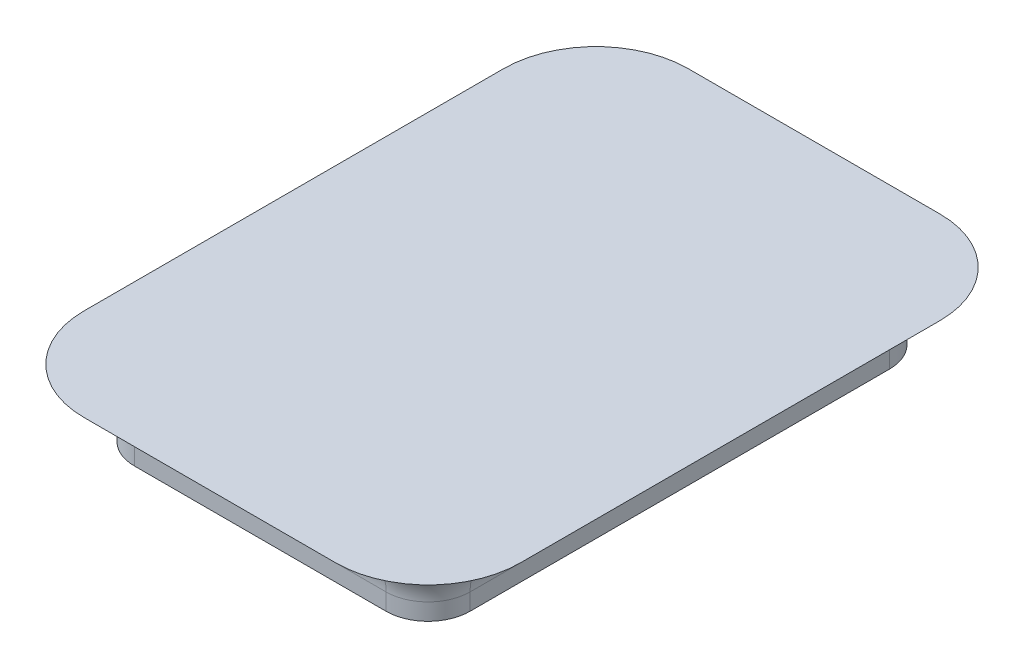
ISO-10303-21;
HEADER;
FILE_DESCRIPTION(('STEP AP214'),'2;1');
FILE_NAME('part.step','',(''),(''),'','','');
FILE_SCHEMA(('AUTOMOTIVE_DESIGN { 1 0 10303 214 1 1 1 1 }'));
ENDSEC;
DATA;
#1=APPLICATION_CONTEXT('core data for automotive mechanical design processes');
#2=APPLICATION_PROTOCOL_DEFINITION('international standard','automotive_design',2000,#1);
#3=PRODUCT_CONTEXT('',#1,'mechanical');
#4=PRODUCT('Part','Part','',(#3));
#5=PRODUCT_RELATED_PRODUCT_CATEGORY('part','',(#4));
#6=PRODUCT_DEFINITION_FORMATION('','',#4);
#7=PRODUCT_DEFINITION_CONTEXT('part definition',#1,'design');
#8=PRODUCT_DEFINITION('design','',#6,#7);
#9=PRODUCT_DEFINITION_SHAPE('','',#8);
#10=(LENGTH_UNIT() NAMED_UNIT(*) SI_UNIT(.MILLI.,.METRE.));
#11=(NAMED_UNIT(*) PLANE_ANGLE_UNIT() SI_UNIT($,.RADIAN.));
#12=(NAMED_UNIT(*) SI_UNIT($,.STERADIAN.) SOLID_ANGLE_UNIT());
#13=UNCERTAINTY_MEASURE_WITH_UNIT(LENGTH_MEASURE(1.E-05),#10,'distance_accuracy_value','');
#14=(GEOMETRIC_REPRESENTATION_CONTEXT(3) GLOBAL_UNCERTAINTY_ASSIGNED_CONTEXT((#13)) GLOBAL_UNIT_ASSIGNED_CONTEXT((#10,
#11,#12)) REPRESENTATION_CONTEXT('',''));
#15=CARTESIAN_POINT('',(0.,0.,0.));
#16=DIRECTION('',(0.,0.,1.));
#17=DIRECTION('',(1.,0.,0.));
#18=AXIS2_PLACEMENT_3D('',#15,#16,#17);
#19=CARTESIAN_POINT('',(-10.,0.,15.));
#20=DIRECTION('',(1.,0.,0.));
#21=DIRECTION('',(0.,1.,0.));
#22=AXIS2_PLACEMENT_3D('',#19,#20,#21);
#23=PLANE('',#22);
#24=DIRECTION('',(0.,-1.,0.));
#25=VECTOR('',#24,1.);
#26=CARTESIAN_POINT('',(-10.,0.,12.5));
#27=LINE('',#26,#25);
#28=CARTESIAN_POINT('',(-10.,-4.,12.5));
#29=VERTEX_POINT('',#28);
#30=CARTESIAN_POINT('',(-10.,-3.,12.5));
#31=VERTEX_POINT('',#30);
#32=EDGE_CURVE('E200',#29,#31,#27,.F.);
#33=ORIENTED_EDGE('',*,*,#32,.T.);
#34=DIRECTION('',(0.,0.,-1.));
#35=VECTOR('',#34,1.);
#36=CARTESIAN_POINT('',(-10.,-3.,15.));
#37=LINE('',#36,#35);
#38=CARTESIAN_POINT('',(-10.,-3.,-12.5));
#39=VERTEX_POINT('',#38);
#40=EDGE_CURVE('E139',#31,#39,#37,.T.);
#41=ORIENTED_EDGE('',*,*,#40,.T.);
#42=DIRECTION('',(0.,-1.,0.));
#43=VECTOR('',#42,1.);
#44=CARTESIAN_POINT('',(-10.,0.,-12.5));
#45=LINE('',#44,#43);
#46=CARTESIAN_POINT('',(-10.,-4.,-12.5));
#47=VERTEX_POINT('',#46);
#48=EDGE_CURVE('E207',#39,#47,#45,.T.);
#49=ORIENTED_EDGE('',*,*,#48,.T.);
#50=DIRECTION('',(0.,0.,-1.));
#51=VECTOR('',#50,1.);
#52=CARTESIAN_POINT('',(-10.,-4.,15.));
#53=LINE('',#52,#51);
#54=EDGE_CURVE('E205',#29,#47,#53,.T.);
#55=ORIENTED_EDGE('',*,*,#54,.F.);
#56=EDGE_LOOP('',(#33,#41,#49,#55));
#57=FACE_BOUND('',#56,.T.);
#58=ADVANCED_FACE('F36',(#57),#23,.F.);
#59=CARTESIAN_POINT('',(10.,-4.,15.));
#60=DIRECTION('',(0.,-1.,0.));
#61=DIRECTION('',(1.,0.,0.));
#62=AXIS2_PLACEMENT_3D('',#59,#60,#61);
#63=PLANE('',#62);
#64=DIRECTION('',(0.,0.,-1.));
#65=VECTOR('',#64,1.);
#66=CARTESIAN_POINT('',(10.,-4.,15.));
#67=LINE('',#66,#65);
#68=CARTESIAN_POINT('',(10.,-4.,12.5));
#69=VERTEX_POINT('',#68);
#70=CARTESIAN_POINT('',(10.,-4.,-12.5));
#71=VERTEX_POINT('',#70);
#72=EDGE_CURVE('E238',#69,#71,#67,.T.);
#73=ORIENTED_EDGE('',*,*,#72,.F.);
#74=CARTESIAN_POINT('',(7.5,-4.,12.5));
#75=DIRECTION('',(0.,-1.,0.));
#76=DIRECTION('',(1.,0.,0.));
#77=AXIS2_PLACEMENT_3D('',#74,#75,#76);
#78=CIRCLE('',#77,2.5);
#79=CARTESIAN_POINT('',(7.5,-4.,15.));
#80=VERTEX_POINT('',#79);
#81=EDGE_CURVE('E211',#69,#80,#78,.T.);
#82=ORIENTED_EDGE('',*,*,#81,.T.);
#83=DIRECTION('',(-1.,0.,0.));
#84=VECTOR('',#83,1.);
#85=CARTESIAN_POINT('',(10.,-4.,15.));
#86=LINE('',#85,#84);
#87=CARTESIAN_POINT('',(-7.5,-4.,15.));
#88=VERTEX_POINT('',#87);
#89=EDGE_CURVE('E180',#80,#88,#86,.T.);
#90=ORIENTED_EDGE('',*,*,#89,.T.);
#91=CARTESIAN_POINT('',(-7.5,-4.,12.5));
#92=DIRECTION('',(0.,-1.,0.));
#93=DIRECTION('',(1.,0.,0.));
#94=AXIS2_PLACEMENT_3D('',#91,#92,#93);
#95=CIRCLE('',#94,2.5);
#96=EDGE_CURVE('E249',#88,#29,#95,.T.);
#97=ORIENTED_EDGE('',*,*,#96,.T.);
#98=ORIENTED_EDGE('',*,*,#54,.T.);
#99=CARTESIAN_POINT('',(-7.5,-4.,-12.5));
#100=DIRECTION('',(0.,-1.,0.));
#101=DIRECTION('',(1.,0.,0.));
#102=AXIS2_PLACEMENT_3D('',#99,#100,#101);
#103=CIRCLE('',#102,2.5);
#104=CARTESIAN_POINT('',(-7.5,-4.,-15.));
#105=VERTEX_POINT('',#104);
#106=EDGE_CURVE('E247',#47,#105,#103,.T.);
#107=ORIENTED_EDGE('',*,*,#106,.T.);
#108=DIRECTION('',(-1.,0.,0.));
#109=VECTOR('',#108,1.);
#110=CARTESIAN_POINT('',(10.,-4.,-15.));
#111=LINE('',#110,#109);
#112=CARTESIAN_POINT('',(7.5,-4.,-15.));
#113=VERTEX_POINT('',#112);
#114=EDGE_CURVE('E231',#113,#105,#111,.T.);
#115=ORIENTED_EDGE('',*,*,#114,.F.);
#116=CARTESIAN_POINT('',(7.5,-4.,-12.5));
#117=DIRECTION('',(0.,-1.,0.));
#118=DIRECTION('',(1.,0.,0.));
#119=AXIS2_PLACEMENT_3D('',#116,#117,#118);
#120=CIRCLE('',#119,2.5);
#121=EDGE_CURVE('E245',#113,#71,#120,.T.);
#122=ORIENTED_EDGE('',*,*,#121,.T.);
#123=EDGE_LOOP('',(#73,#82,#90,#97,#98,#107,#115,#122));
#124=FACE_BOUND('',#123,.T.);
#125=ADVANCED_FACE('F252',(#124),#63,.T.);
#126=CARTESIAN_POINT('',(10.,-4.,15.));
#127=DIRECTION('',(-1.,0.,0.));
#128=DIRECTION('',(0.,-1.,0.));
#129=AXIS2_PLACEMENT_3D('',#126,#127,#128);
#130=PLANE('',#129);
#131=DIRECTION('',(0.,1.,0.));
#132=VECTOR('',#131,1.);
#133=CARTESIAN_POINT('',(10.,-4.,-12.5));
#134=LINE('',#133,#132);
#135=CARTESIAN_POINT('',(10.,-3.,-12.5));
#136=VERTEX_POINT('',#135);
#137=EDGE_CURVE('E181',#71,#136,#134,.T.);
#138=ORIENTED_EDGE('',*,*,#137,.T.);
#139=DIRECTION('',(0.,0.,-1.));
#140=VECTOR('',#139,1.);
#141=CARTESIAN_POINT('',(10.,-3.,15.));
#142=LINE('',#141,#140);
#143=CARTESIAN_POINT('',(10.,-3.,12.5));
#144=VERTEX_POINT('',#143);
#145=EDGE_CURVE('E11',#136,#144,#142,.F.);
#146=ORIENTED_EDGE('',*,*,#145,.T.);
#147=DIRECTION('',(0.,1.,0.));
#148=VECTOR('',#147,1.);
#149=CARTESIAN_POINT('',(10.,-4.,12.5));
#150=LINE('',#149,#148);
#151=EDGE_CURVE('E169',#144,#69,#150,.F.);
#152=ORIENTED_EDGE('',*,*,#151,.T.);
#153=ORIENTED_EDGE('',*,*,#72,.T.);
#154=EDGE_LOOP('',(#138,#146,#152,#153));
#155=FACE_BOUND('',#154,.T.);
#156=ADVANCED_FACE('F255',(#155),#130,.F.);
#157=CARTESIAN_POINT('',(-10.,0.,15.));
#158=DIRECTION('',(0.,0.,1.));
#159=DIRECTION('',(1.,0.,0.));
#160=AXIS2_PLACEMENT_3D('',#157,#158,#159);
#161=PLANE('',#160);
#162=DIRECTION('',(0.,1.,0.));
#163=VECTOR('',#162,1.);
#164=CARTESIAN_POINT('',(7.5,0.,15.));
#165=LINE('',#164,#163);
#166=CARTESIAN_POINT('',(7.5,-3.,15.));
#167=VERTEX_POINT('',#166);
#168=EDGE_CURVE('E168',#80,#167,#165,.T.);
#169=ORIENTED_EDGE('',*,*,#168,.T.);
#170=DIRECTION('',(1.,0.,0.));
#171=VECTOR('',#170,1.);
#172=CARTESIAN_POINT('',(-7.5,-3.,15.));
#173=LINE('',#172,#171);
#174=CARTESIAN_POINT('',(-7.5,-3.,15.));
#175=VERTEX_POINT('',#174);
#176=EDGE_CURVE('E157',#167,#175,#173,.F.);
#177=ORIENTED_EDGE('',*,*,#176,.T.);
#178=DIRECTION('',(0.,-1.,0.));
#179=VECTOR('',#178,1.);
#180=CARTESIAN_POINT('',(-7.5,-4.,15.));
#181=LINE('',#180,#179);
#182=EDGE_CURVE('E182',#175,#88,#181,.T.);
#183=ORIENTED_EDGE('',*,*,#182,.T.);
#184=ORIENTED_EDGE('',*,*,#89,.F.);
#185=EDGE_LOOP('',(#169,#177,#183,#184));
#186=FACE_BOUND('',#185,.T.);
#187=ADVANCED_FACE('F176',(#186),#161,.T.);
#188=CARTESIAN_POINT('',(-10.,0.,-15.));
#189=DIRECTION('',(0.,0.,1.));
#190=DIRECTION('',(1.,0.,0.));
#191=AXIS2_PLACEMENT_3D('',#188,#189,#190);
#192=PLANE('',#191);
#193=DIRECTION('',(0.,-1.,0.));
#194=VECTOR('',#193,1.);
#195=CARTESIAN_POINT('',(-7.5,0.,-15.));
#196=LINE('',#195,#194);
#197=CARTESIAN_POINT('',(-7.5,-3.,-15.));
#198=VERTEX_POINT('',#197);
#199=EDGE_CURVE('E209',#105,#198,#196,.F.);
#200=ORIENTED_EDGE('',*,*,#199,.T.);
#201=DIRECTION('',(1.,0.,0.));
#202=VECTOR('',#201,1.);
#203=CARTESIAN_POINT('',(-10.,-3.,-15.));
#204=LINE('',#203,#202);
#205=CARTESIAN_POINT('',(7.5,-3.,-15.));
#206=VERTEX_POINT('',#205);
#207=EDGE_CURVE('E159',#198,#206,#204,.T.);
#208=ORIENTED_EDGE('',*,*,#207,.T.);
#209=DIRECTION('',(0.,1.,0.));
#210=VECTOR('',#209,1.);
#211=CARTESIAN_POINT('',(7.5,0.,-15.));
#212=LINE('',#211,#210);
#213=EDGE_CURVE('E206',#206,#113,#212,.F.);
#214=ORIENTED_EDGE('',*,*,#213,.T.);
#215=ORIENTED_EDGE('',*,*,#114,.T.);
#216=EDGE_LOOP('',(#200,#208,#214,#215));
#217=FACE_BOUND('',#216,.T.);
#218=ADVANCED_FACE('F278',(#217),#192,.F.);
#219=CARTESIAN_POINT('',(7.5,0.,12.5));
#220=DIRECTION('',(0.,-1.,0.));
#221=DIRECTION('',(1.,0.,0.));
#222=AXIS2_PLACEMENT_3D('',#219,#220,#221);
#223=CYLINDRICAL_SURFACE('',#222,2.5);
#224=ORIENTED_EDGE('',*,*,#151,.F.);
#225=CARTESIAN_POINT('',(7.5,-3.,12.5));
#226=DIRECTION('',(0.,-1.,0.));
#227=DIRECTION('',(0.,0.,-1.));
#228=AXIS2_PLACEMENT_3D('',#225,#226,#227);
#229=CIRCLE('',#228,2.5);
#230=EDGE_CURVE('E161',#144,#167,#229,.T.);
#231=ORIENTED_EDGE('',*,*,#230,.T.);
#232=ORIENTED_EDGE('',*,*,#168,.F.);
#233=ORIENTED_EDGE('',*,*,#81,.F.);
#234=EDGE_LOOP('',(#224,#231,#232,#233));
#235=FACE_BOUND('',#234,.T.);
#236=ADVANCED_FACE('F166',(#235),#223,.T.);
#237=CARTESIAN_POINT('',(-7.5,0.,12.5));
#238=DIRECTION('',(0.,1.,0.));
#239=DIRECTION('',(-1.,0.,0.));
#240=AXIS2_PLACEMENT_3D('',#237,#238,#239);
#241=CYLINDRICAL_SURFACE('',#240,2.5);
#242=ORIENTED_EDGE('',*,*,#182,.F.);
#243=CARTESIAN_POINT('',(-7.5,-3.,12.5));
#244=DIRECTION('',(0.,-1.,0.));
#245=DIRECTION('',(0.,0.,-1.));
#246=AXIS2_PLACEMENT_3D('',#243,#244,#245);
#247=CIRCLE('',#246,2.5);
#248=EDGE_CURVE('E132',#175,#31,#247,.T.);
#249=ORIENTED_EDGE('',*,*,#248,.T.);
#250=ORIENTED_EDGE('',*,*,#32,.F.);
#251=ORIENTED_EDGE('',*,*,#96,.F.);
#252=EDGE_LOOP('',(#242,#249,#250,#251));
#253=FACE_BOUND('',#252,.T.);
#254=ADVANCED_FACE('F198',(#253),#241,.T.);
#255=CARTESIAN_POINT('',(-7.5,0.,-12.5));
#256=DIRECTION('',(0.,-1.,0.));
#257=DIRECTION('',(1.,0.,0.));
#258=AXIS2_PLACEMENT_3D('',#255,#256,#257);
#259=CYLINDRICAL_SURFACE('',#258,2.5);
#260=ORIENTED_EDGE('',*,*,#48,.F.);
#261=CARTESIAN_POINT('',(-7.5,-3.,-12.5));
#262=DIRECTION('',(0.,-1.,0.));
#263=DIRECTION('',(0.,0.,-1.));
#264=AXIS2_PLACEMENT_3D('',#261,#262,#263);
#265=CIRCLE('',#264,2.5);
#266=EDGE_CURVE('E155',#39,#198,#265,.T.);
#267=ORIENTED_EDGE('',*,*,#266,.T.);
#268=ORIENTED_EDGE('',*,*,#199,.F.);
#269=ORIENTED_EDGE('',*,*,#106,.F.);
#270=EDGE_LOOP('',(#260,#267,#268,#269));
#271=FACE_BOUND('',#270,.T.);
#272=ADVANCED_FACE('F276',(#271),#259,.T.);
#273=CARTESIAN_POINT('',(7.5,-4.,-12.5));
#274=DIRECTION('',(0.,1.,0.));
#275=DIRECTION('',(-1.,0.,0.));
#276=AXIS2_PLACEMENT_3D('',#273,#274,#275);
#277=CYLINDRICAL_SURFACE('',#276,2.5);
#278=ORIENTED_EDGE('',*,*,#213,.F.);
#279=CARTESIAN_POINT('',(7.5,-3.,-12.5));
#280=DIRECTION('',(0.,-1.,0.));
#281=DIRECTION('',(0.,0.,-1.));
#282=AXIS2_PLACEMENT_3D('',#279,#280,#281);
#283=CIRCLE('',#282,2.5);
#284=EDGE_CURVE('E43',#206,#136,#283,.T.);
#285=ORIENTED_EDGE('',*,*,#284,.T.);
#286=ORIENTED_EDGE('',*,*,#137,.F.);
#287=ORIENTED_EDGE('',*,*,#121,.F.);
#288=EDGE_LOOP('',(#278,#285,#286,#287));
#289=FACE_BOUND('',#288,.T.);
#290=ADVANCED_FACE('F256',(#289),#277,.T.);
#291=CARTESIAN_POINT('',(13.,-3.,25.));
#292=DIRECTION('',(0.,0.,-1.));
#293=DIRECTION('',(-1.,0.,0.));
#294=AXIS2_PLACEMENT_3D('',#291,#292,#293);
#295=CYLINDRICAL_SURFACE('',#294,3.);
#296=CARTESIAN_POINT('',(13.,-3.,-12.5));
#297=DIRECTION('',(0.,0.,1.));
#298=DIRECTION('',(1.,0.,0.));
#299=AXIS2_PLACEMENT_3D('',#296,#297,#298);
#300=CIRCLE('',#299,3.);
#301=CARTESIAN_POINT('',(13.,0.,-12.5));
#302=VERTEX_POINT('',#301);
#303=EDGE_CURVE('E190',#302,#136,#300,.T.);
#304=ORIENTED_EDGE('',*,*,#303,.F.);
#305=DIRECTION('',(0.,0.,-1.));
#306=VECTOR('',#305,1.);
#307=CARTESIAN_POINT('',(13.,0.,25.));
#308=LINE('',#307,#306);
#309=CARTESIAN_POINT('',(13.,0.,12.5));
#310=VERTEX_POINT('',#309);
#311=EDGE_CURVE('E218',#310,#302,#308,.T.);
#312=ORIENTED_EDGE('',*,*,#311,.F.);
#313=CARTESIAN_POINT('',(13.,-3.,12.5));
#314=DIRECTION('',(0.,0.,-1.));
#315=DIRECTION('',(-1.,0.,0.));
#316=AXIS2_PLACEMENT_3D('',#313,#314,#315);
#317=CIRCLE('',#316,3.);
#318=EDGE_CURVE('E228',#144,#310,#317,.T.);
#319=ORIENTED_EDGE('',*,*,#318,.F.);
#320=ORIENTED_EDGE('',*,*,#145,.F.);
#321=EDGE_LOOP('',(#304,#312,#319,#320));
#322=FACE_BOUND('',#321,.T.);
#323=ADVANCED_FACE('F227',(#322),#295,.F.);
#324=CARTESIAN_POINT('',(7.5,-3.,12.5));
#325=DIRECTION('',(0.,-1.,0.));
#326=DIRECTION('',(0.,0.,-1.));
#327=AXIS2_PLACEMENT_3D('',#324,#325,#326);
#328=TOROIDAL_SURFACE('',#327,5.5,3.);
#329=ORIENTED_EDGE('',*,*,#318,.T.);
#330=CARTESIAN_POINT('',(7.5,0.,12.5));
#331=DIRECTION('',(0.,-1.,0.));
#332=DIRECTION('',(0.,0.,-1.));
#333=AXIS2_PLACEMENT_3D('',#330,#331,#332);
#334=CIRCLE('',#333,5.5);
#335=CARTESIAN_POINT('',(7.5,0.,18.));
#336=VERTEX_POINT('',#335);
#337=EDGE_CURVE('E188',#336,#310,#334,.F.);
#338=ORIENTED_EDGE('',*,*,#337,.F.);
#339=CARTESIAN_POINT('',(7.5,-3.,18.));
#340=DIRECTION('',(1.,0.,0.));
#341=DIRECTION('',(0.,0.,-1.));
#342=AXIS2_PLACEMENT_3D('',#339,#340,#341);
#343=CIRCLE('',#342,3.);
#344=EDGE_CURVE('E186',#167,#336,#343,.T.);
#345=ORIENTED_EDGE('',*,*,#344,.F.);
#346=ORIENTED_EDGE('',*,*,#230,.F.);
#347=EDGE_LOOP('',(#329,#338,#345,#346));
#348=FACE_BOUND('',#347,.T.);
#349=ADVANCED_FACE('F187',(#348),#328,.F.);
#350=CARTESIAN_POINT('',(7.5,-3.,-12.5));
#351=DIRECTION('',(0.,-1.,0.));
#352=DIRECTION('',(0.,0.,-1.));
#353=AXIS2_PLACEMENT_3D('',#350,#351,#352);
#354=TOROIDAL_SURFACE('',#353,5.5,3.);
#355=ORIENTED_EDGE('',*,*,#303,.T.);
#356=ORIENTED_EDGE('',*,*,#284,.F.);
#357=CARTESIAN_POINT('',(7.5,-3.,-18.));
#358=DIRECTION('',(1.,0.,0.));
#359=DIRECTION('',(0.,0.,-1.));
#360=AXIS2_PLACEMENT_3D('',#357,#358,#359);
#361=CIRCLE('',#360,3.);
#362=CARTESIAN_POINT('',(7.5,0.,-18.));
#363=VERTEX_POINT('',#362);
#364=EDGE_CURVE('E191',#363,#206,#361,.T.);
#365=ORIENTED_EDGE('',*,*,#364,.F.);
#366=CARTESIAN_POINT('',(7.5,0.,-12.5));
#367=DIRECTION('',(0.,-1.,0.));
#368=DIRECTION('',(0.,0.,-1.));
#369=AXIS2_PLACEMENT_3D('',#366,#367,#368);
#370=CIRCLE('',#369,5.5);
#371=EDGE_CURVE('E220',#302,#363,#370,.F.);
#372=ORIENTED_EDGE('',*,*,#371,.F.);
#373=EDGE_LOOP('',(#355,#356,#365,#372));
#374=FACE_BOUND('',#373,.T.);
#375=ADVANCED_FACE('F261',(#374),#354,.F.);
#376=CARTESIAN_POINT('',(25.,-3.,18.));
#377=DIRECTION('',(-1.,0.,0.));
#378=DIRECTION('',(0.,0.,1.));
#379=AXIS2_PLACEMENT_3D('',#376,#377,#378);
#380=CYLINDRICAL_SURFACE('',#379,3.);
#381=ORIENTED_EDGE('',*,*,#344,.T.);
#382=DIRECTION('',(1.,0.,0.));
#383=VECTOR('',#382,1.);
#384=CARTESIAN_POINT('',(7.5,0.,18.));
#385=LINE('',#384,#383);
#386=CARTESIAN_POINT('',(-7.5,0.,18.));
#387=VERTEX_POINT('',#386);
#388=EDGE_CURVE('E150',#387,#336,#385,.T.);
#389=ORIENTED_EDGE('',*,*,#388,.F.);
#390=CARTESIAN_POINT('',(-7.5,-3.,18.));
#391=DIRECTION('',(1.,0.,0.));
#392=DIRECTION('',(0.,0.,-1.));
#393=AXIS2_PLACEMENT_3D('',#390,#391,#392);
#394=CIRCLE('',#393,3.);
#395=EDGE_CURVE('E148',#175,#387,#394,.T.);
#396=ORIENTED_EDGE('',*,*,#395,.F.);
#397=ORIENTED_EDGE('',*,*,#176,.F.);
#398=EDGE_LOOP('',(#381,#389,#396,#397));
#399=FACE_BOUND('',#398,.T.);
#400=ADVANCED_FACE('F193',(#399),#380,.F.);
#401=CARTESIAN_POINT('',(-10.,-3.,-18.));
#402=DIRECTION('',(1.,0.,0.));
#403=DIRECTION('',(0.,0.,-1.));
#404=AXIS2_PLACEMENT_3D('',#401,#402,#403);
#405=CYLINDRICAL_SURFACE('',#404,3.);
#406=ORIENTED_EDGE('',*,*,#364,.T.);
#407=ORIENTED_EDGE('',*,*,#207,.F.);
#408=CARTESIAN_POINT('',(-7.5,-3.,-18.));
#409=DIRECTION('',(1.,0.,0.));
#410=DIRECTION('',(0.,0.,-1.));
#411=AXIS2_PLACEMENT_3D('',#408,#409,#410);
#412=CIRCLE('',#411,3.);
#413=CARTESIAN_POINT('',(-7.5,0.,-18.));
#414=VERTEX_POINT('',#413);
#415=EDGE_CURVE('E142',#414,#198,#412,.T.);
#416=ORIENTED_EDGE('',*,*,#415,.F.);
#417=DIRECTION('',(1.,0.,0.));
#418=VECTOR('',#417,1.);
#419=CARTESIAN_POINT('',(25.,0.,-18.));
#420=LINE('',#419,#418);
#421=EDGE_CURVE('E223',#363,#414,#420,.F.);
#422=ORIENTED_EDGE('',*,*,#421,.F.);
#423=EDGE_LOOP('',(#406,#407,#416,#422));
#424=FACE_BOUND('',#423,.T.);
#425=ADVANCED_FACE('F265',(#424),#405,.F.);
#426=CARTESIAN_POINT('',(-7.5,-3.,12.5));
#427=DIRECTION('',(0.,-1.,0.));
#428=DIRECTION('',(0.,0.,-1.));
#429=AXIS2_PLACEMENT_3D('',#426,#427,#428);
#430=TOROIDAL_SURFACE('',#429,5.5,3.);
#431=ORIENTED_EDGE('',*,*,#395,.T.);
#432=CARTESIAN_POINT('',(-7.5,0.,12.5));
#433=DIRECTION('',(0.,-1.,0.));
#434=DIRECTION('',(0.,0.,-1.));
#435=AXIS2_PLACEMENT_3D('',#432,#433,#434);
#436=CIRCLE('',#435,5.5);
#437=CARTESIAN_POINT('',(-13.,0.,12.5));
#438=VERTEX_POINT('',#437);
#439=EDGE_CURVE('E126',#438,#387,#436,.F.);
#440=ORIENTED_EDGE('',*,*,#439,.F.);
#441=CARTESIAN_POINT('',(-13.,-3.,12.5));
#442=DIRECTION('',(0.,0.,1.));
#443=DIRECTION('',(1.,0.,0.));
#444=AXIS2_PLACEMENT_3D('',#441,#442,#443);
#445=CIRCLE('',#444,3.);
#446=EDGE_CURVE('E136',#31,#438,#445,.T.);
#447=ORIENTED_EDGE('',*,*,#446,.F.);
#448=ORIENTED_EDGE('',*,*,#248,.F.);
#449=EDGE_LOOP('',(#431,#440,#447,#448));
#450=FACE_BOUND('',#449,.T.);
#451=ADVANCED_FACE('F146',(#450),#430,.F.);
#452=CARTESIAN_POINT('',(-7.5,-3.,-12.5));
#453=DIRECTION('',(0.,-1.,0.));
#454=DIRECTION('',(0.,0.,-1.));
#455=AXIS2_PLACEMENT_3D('',#452,#453,#454);
#456=TOROIDAL_SURFACE('',#455,5.5,3.);
#457=ORIENTED_EDGE('',*,*,#415,.T.);
#458=ORIENTED_EDGE('',*,*,#266,.F.);
#459=CARTESIAN_POINT('',(-13.,-3.,-12.5));
#460=DIRECTION('',(0.,0.,-1.));
#461=DIRECTION('',(-1.,0.,0.));
#462=AXIS2_PLACEMENT_3D('',#459,#460,#461);
#463=CIRCLE('',#462,3.);
#464=CARTESIAN_POINT('',(-13.,0.,-12.5));
#465=VERTEX_POINT('',#464);
#466=EDGE_CURVE('E143',#465,#39,#463,.T.);
#467=ORIENTED_EDGE('',*,*,#466,.F.);
#468=CARTESIAN_POINT('',(-7.5,0.,-12.5));
#469=DIRECTION('',(0.,-1.,0.));
#470=DIRECTION('',(0.,0.,-1.));
#471=AXIS2_PLACEMENT_3D('',#468,#469,#470);
#472=CIRCLE('',#471,5.5);
#473=EDGE_CURVE('E129',#414,#465,#472,.F.);
#474=ORIENTED_EDGE('',*,*,#473,.F.);
#475=EDGE_LOOP('',(#457,#458,#467,#474));
#476=FACE_BOUND('',#475,.T.);
#477=ADVANCED_FACE('F273',(#476),#456,.F.);
#478=CARTESIAN_POINT('',(-13.,-3.,15.));
#479=DIRECTION('',(0.,0.,-1.));
#480=DIRECTION('',(-1.,0.,0.));
#481=AXIS2_PLACEMENT_3D('',#478,#479,#480);
#482=CYLINDRICAL_SURFACE('',#481,3.);
#483=ORIENTED_EDGE('',*,*,#446,.T.);
#484=DIRECTION('',(0.,0.,-1.));
#485=VECTOR('',#484,1.);
#486=CARTESIAN_POINT('',(-13.,0.,25.));
#487=LINE('',#486,#485);
#488=EDGE_CURVE('E122',#465,#438,#487,.F.);
#489=ORIENTED_EDGE('',*,*,#488,.F.);
#490=ORIENTED_EDGE('',*,*,#466,.T.);
#491=ORIENTED_EDGE('',*,*,#40,.F.);
#492=EDGE_LOOP('',(#483,#489,#490,#491));
#493=FACE_BOUND('',#492,.T.);
#494=ADVANCED_FACE('F137',(#493),#482,.F.);
#495=CARTESIAN_POINT('',(-25.,0.,25.));
#496=DIRECTION('',(0.,-1.,0.));
#497=DIRECTION('',(0.,0.,-1.));
#498=AXIS2_PLACEMENT_3D('',#495,#496,#497);
#499=PLANE('',#498);
#500=ORIENTED_EDGE('',*,*,#371,.T.);
#501=ORIENTED_EDGE('',*,*,#421,.T.);
#502=ORIENTED_EDGE('',*,*,#473,.T.);
#503=ORIENTED_EDGE('',*,*,#488,.T.);
#504=ORIENTED_EDGE('',*,*,#439,.T.);
#505=ORIENTED_EDGE('',*,*,#388,.T.);
#506=ORIENTED_EDGE('',*,*,#337,.T.);
#507=ORIENTED_EDGE('',*,*,#311,.T.);
#508=EDGE_LOOP('',(#500,#501,#502,#503,#504,#505,#506,#507));
#509=FACE_BOUND('',#508,.T.);
#510=ADVANCED_FACE('F124',(#509),#499,.F.);
#511=CLOSED_SHELL('',(#58,#125,#156,#187,#218,#236,#254,#272,#290,#323,#349,#375,#400,#425,#451,
#477,#494,#510));
#512=MANIFOLD_SOLID_BREP('B2',#511);
#513=ADVANCED_BREP_SHAPE_REPRESENTATION('',(#18,#512),#14);
#514=SHAPE_DEFINITION_REPRESENTATION(#9,#513);
ENDSEC;
END-ISO-10303-21;
